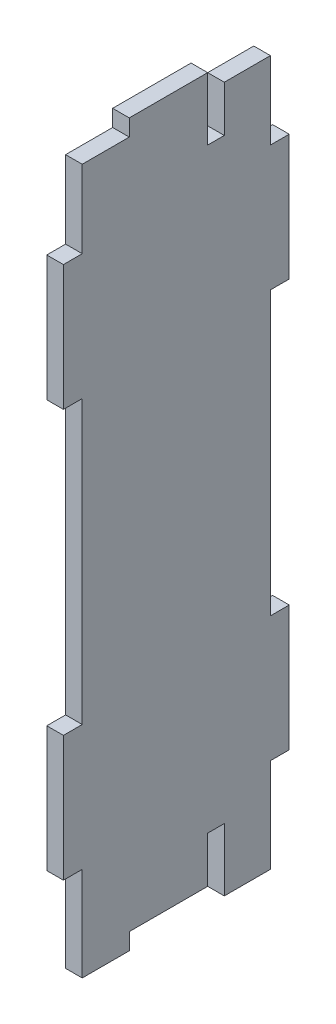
ISO-10303-21;
HEADER;
FILE_DESCRIPTION(('STEP AP214'),'2;1');
FILE_NAME('part.step','',(''),(''),'','','');
FILE_SCHEMA(('AUTOMOTIVE_DESIGN { 1 0 10303 214 1 1 1 1 }'));
ENDSEC;
DATA;
#1=APPLICATION_CONTEXT('core data for automotive mechanical design processes');
#2=APPLICATION_PROTOCOL_DEFINITION('international standard','automotive_design',2000,#1);
#3=PRODUCT_CONTEXT('',#1,'mechanical');
#4=PRODUCT('Part','Part','',(#3));
#5=PRODUCT_RELATED_PRODUCT_CATEGORY('part','',(#4));
#6=PRODUCT_DEFINITION_FORMATION('','',#4);
#7=PRODUCT_DEFINITION_CONTEXT('part definition',#1,'design');
#8=PRODUCT_DEFINITION('design','',#6,#7);
#9=PRODUCT_DEFINITION_SHAPE('','',#8);
#10=(LENGTH_UNIT() NAMED_UNIT(*) SI_UNIT(.MILLI.,.METRE.));
#11=(NAMED_UNIT(*) PLANE_ANGLE_UNIT() SI_UNIT($,.RADIAN.));
#12=(NAMED_UNIT(*) SI_UNIT($,.STERADIAN.) SOLID_ANGLE_UNIT());
#13=UNCERTAINTY_MEASURE_WITH_UNIT(LENGTH_MEASURE(1.E-05),#10,'distance_accuracy_value','');
#14=(GEOMETRIC_REPRESENTATION_CONTEXT(3) GLOBAL_UNCERTAINTY_ASSIGNED_CONTEXT((#13)) GLOBAL_UNIT_ASSIGNED_CONTEXT((#10,
#11,#12)) REPRESENTATION_CONTEXT('',''));
#15=CARTESIAN_POINT('',(0.,0.,0.));
#16=DIRECTION('',(0.,0.,1.));
#17=DIRECTION('',(1.,0.,0.));
#18=AXIS2_PLACEMENT_3D('',#15,#16,#17);
#19=CARTESIAN_POINT('',(0.,0.,30.));
#20=DIRECTION('',(0.,0.,1.));
#21=DIRECTION('',(1.,0.,0.));
#22=AXIS2_PLACEMENT_3D('',#19,#20,#21);
#23=PLANE('',#22);
#24=DIRECTION('',(0.,-1.,0.));
#25=VECTOR('',#24,1.);
#26=CARTESIAN_POINT('',(117.35,5.00000000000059,30.));
#27=LINE('',#26,#25);
#28=CARTESIAN_POINT('',(117.35,85.,30.));
#29=VERTEX_POINT('',#28);
#30=CARTESIAN_POINT('',(117.35,40.,30.));
#31=VERTEX_POINT('',#30);
#32=EDGE_CURVE('E467',#29,#31,#27,.T.);
#33=ORIENTED_EDGE('',*,*,#32,.T.);
#34=DIRECTION('',(-1.,0.,0.));
#35=VECTOR('',#34,1.);
#36=CARTESIAN_POINT('',(117.35,40.,30.));
#37=LINE('',#36,#35);
#38=CARTESIAN_POINT('',(120.,40.,30.));
#39=VERTEX_POINT('',#38);
#40=EDGE_CURVE('E304',#39,#31,#37,.T.);
#41=ORIENTED_EDGE('',*,*,#40,.F.);
#42=DIRECTION('',(0.,1.,0.));
#43=VECTOR('',#42,1.);
#44=CARTESIAN_POINT('',(120.,5.00000000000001,30.));
#45=LINE('',#44,#43);
#46=CARTESIAN_POINT('',(120.,85.,30.));
#47=VERTEX_POINT('',#46);
#48=EDGE_CURVE('E471',#39,#47,#45,.T.);
#49=ORIENTED_EDGE('',*,*,#48,.T.);
#50=DIRECTION('',(1.,0.,0.));
#51=VECTOR('',#50,1.);
#52=CARTESIAN_POINT('',(120.,85.,30.));
#53=LINE('',#52,#51);
#54=EDGE_CURVE('E334',#29,#47,#53,.T.);
#55=ORIENTED_EDGE('',*,*,#54,.F.);
#56=EDGE_LOOP('',(#33,#41,#49,#55));
#57=FACE_BOUND('',#56,.T.);
#58=ADVANCED_FACE('F33',(#57),#23,.T.);
#59=CARTESIAN_POINT('',(120.,5.00000000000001,30.));
#60=VERTEX_POINT('',#59);
#61=CARTESIAN_POINT('',(120.,19.9999999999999,30.));
#62=VERTEX_POINT('',#61);
#63=EDGE_CURVE('E469',#60,#62,#45,.T.);
#64=ORIENTED_EDGE('',*,*,#63,.T.);
#65=DIRECTION('',(1.,0.,0.));
#66=VECTOR('',#65,1.);
#67=CARTESIAN_POINT('',(120.,19.9999999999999,30.));
#68=LINE('',#67,#66);
#69=CARTESIAN_POINT('',(117.35,19.9999999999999,30.));
#70=VERTEX_POINT('',#69);
#71=EDGE_CURVE('E290',#70,#62,#68,.T.);
#72=ORIENTED_EDGE('',*,*,#71,.F.);
#73=CARTESIAN_POINT('',(117.35,5.00000000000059,30.));
#74=VERTEX_POINT('',#73);
#75=EDGE_CURVE('E468',#70,#74,#27,.T.);
#76=ORIENTED_EDGE('',*,*,#75,.T.);
#77=DIRECTION('',(1.,-2.19622538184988E-13,0.));
#78=VECTOR('',#77,1.);
#79=CARTESIAN_POINT('',(120.,5.00000000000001,30.));
#80=LINE('',#79,#78);
#81=EDGE_CURVE('E450',#74,#60,#80,.T.);
#82=ORIENTED_EDGE('',*,*,#81,.T.);
#83=EDGE_LOOP('',(#64,#72,#76,#82));
#84=FACE_BOUND('',#83,.T.);
#85=ADVANCED_FACE('F524',(#84),#23,.T.);
#86=CARTESIAN_POINT('',(0.,0.,0.));
#87=DIRECTION('',(0.,0.,1.));
#88=DIRECTION('',(1.,0.,0.));
#89=AXIS2_PLACEMENT_3D('',#86,#87,#88);
#90=PLANE('',#89);
#91=DIRECTION('',(1.,0.,0.));
#92=VECTOR('',#91,1.);
#93=CARTESIAN_POINT('',(120.,40.,0.));
#94=LINE('',#93,#92);
#95=CARTESIAN_POINT('',(117.35,40.,0.));
#96=VERTEX_POINT('',#95);
#97=CARTESIAN_POINT('',(120.,40.,0.));
#98=VERTEX_POINT('',#97);
#99=EDGE_CURVE('E351',#96,#98,#94,.T.);
#100=ORIENTED_EDGE('',*,*,#99,.F.);
#101=DIRECTION('',(0.,-1.,0.));
#102=VECTOR('',#101,1.);
#103=CARTESIAN_POINT('',(117.35,5.00000000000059,0.));
#104=LINE('',#103,#102);
#105=CARTESIAN_POINT('',(117.35,85.,0.));
#106=VERTEX_POINT('',#105);
#107=EDGE_CURVE('E456',#106,#96,#104,.T.);
#108=ORIENTED_EDGE('',*,*,#107,.F.);
#109=DIRECTION('',(-1.,0.,0.));
#110=VECTOR('',#109,1.);
#111=CARTESIAN_POINT('',(120.,85.,0.));
#112=LINE('',#111,#110);
#113=CARTESIAN_POINT('',(120.,85.,0.));
#114=VERTEX_POINT('',#113);
#115=EDGE_CURVE('E382',#114,#106,#112,.T.);
#116=ORIENTED_EDGE('',*,*,#115,.F.);
#117=DIRECTION('',(0.,1.,0.));
#118=VECTOR('',#117,1.);
#119=CARTESIAN_POINT('',(120.,5.00000000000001,0.));
#120=LINE('',#119,#118);
#121=EDGE_CURVE('E462',#98,#114,#120,.T.);
#122=ORIENTED_EDGE('',*,*,#121,.F.);
#123=EDGE_LOOP('',(#100,#108,#116,#122));
#124=FACE_BOUND('',#123,.T.);
#125=ADVANCED_FACE('F555',(#124),#90,.F.);
#126=DIRECTION('',(-1.,0.,0.));
#127=VECTOR('',#126,1.);
#128=CARTESIAN_POINT('',(120.,19.9999999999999,0.));
#129=LINE('',#128,#127);
#130=CARTESIAN_POINT('',(120.,19.9999999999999,0.));
#131=VERTEX_POINT('',#130);
#132=CARTESIAN_POINT('',(117.35,19.9999999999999,0.));
#133=VERTEX_POINT('',#132);
#134=EDGE_CURVE('E356',#131,#133,#129,.T.);
#135=ORIENTED_EDGE('',*,*,#134,.F.);
#136=CARTESIAN_POINT('',(120.,5.00000000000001,0.));
#137=VERTEX_POINT('',#136);
#138=EDGE_CURVE('E458',#137,#131,#120,.T.);
#139=ORIENTED_EDGE('',*,*,#138,.F.);
#140=DIRECTION('',(1.,-2.19622538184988E-13,0.));
#141=VECTOR('',#140,1.);
#142=CARTESIAN_POINT('',(120.,5.00000000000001,0.));
#143=LINE('',#142,#141);
#144=CARTESIAN_POINT('',(117.35,5.00000000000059,0.));
#145=VERTEX_POINT('',#144);
#146=EDGE_CURVE('E447',#145,#137,#143,.T.);
#147=ORIENTED_EDGE('',*,*,#146,.F.);
#148=EDGE_CURVE('E457',#133,#145,#104,.T.);
#149=ORIENTED_EDGE('',*,*,#148,.F.);
#150=EDGE_LOOP('',(#135,#139,#147,#149));
#151=FACE_BOUND('',#150,.T.);
#152=ADVANCED_FACE('F577',(#151),#90,.F.);
#153=DIRECTION('',(1.,0.,0.));
#154=VECTOR('',#153,1.);
#155=CARTESIAN_POINT('',(120.,105.,0.));
#156=LINE('',#155,#154);
#157=CARTESIAN_POINT('',(117.35,105.,0.));
#158=VERTEX_POINT('',#157);
#159=CARTESIAN_POINT('',(120.,105.,0.));
#160=VERTEX_POINT('',#159);
#161=EDGE_CURVE('E377',#158,#160,#156,.T.);
#162=ORIENTED_EDGE('',*,*,#161,.F.);
#163=CARTESIAN_POINT('',(117.35,117.35,0.));
#164=VERTEX_POINT('',#163);
#165=EDGE_CURVE('E452',#164,#158,#104,.T.);
#166=ORIENTED_EDGE('',*,*,#165,.F.);
#167=DIRECTION('',(1.,0.,0.));
#168=VECTOR('',#167,1.);
#169=CARTESIAN_POINT('',(102.117715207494,117.35,0.));
#170=LINE('',#169,#168);
#171=CARTESIAN_POINT('',(120.,117.35,0.));
#172=VERTEX_POINT('',#171);
#173=EDGE_CURVE('E443',#164,#172,#170,.T.);
#174=ORIENTED_EDGE('',*,*,#173,.T.);
#175=EDGE_CURVE('E463',#160,#172,#120,.T.);
#176=ORIENTED_EDGE('',*,*,#175,.F.);
#177=EDGE_LOOP('',(#162,#166,#174,#176));
#178=FACE_BOUND('',#177,.T.);
#179=ADVANCED_FACE('F572',(#178),#90,.F.);
#180=CARTESIAN_POINT('',(120.,5.00000000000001,145.030528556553));
#181=DIRECTION('',(2.19622538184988E-13,1.,0.));
#182=DIRECTION('',(-1.,2.19622538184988E-13,0.));
#183=AXIS2_PLACEMENT_3D('',#180,#181,#182);
#184=PLANE('',#183);
#185=DIRECTION('',(0.,0.,-1.));
#186=VECTOR('',#185,1.);
#187=CARTESIAN_POINT('',(117.35,5.00000000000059,145.030528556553));
#188=LINE('',#187,#186);
#189=CARTESIAN_POINT('',(117.35,5.00000000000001,22.5000000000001));
#190=VERTEX_POINT('',#189);
#191=EDGE_CURVE('E451',#74,#190,#188,.T.);
#192=ORIENTED_EDGE('',*,*,#191,.T.);
#193=DIRECTION('',(1.,0.,0.));
#194=VECTOR('',#193,1.);
#195=CARTESIAN_POINT('',(102.117715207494,5.00000000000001,22.5000000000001));
#196=LINE('',#195,#194);
#197=CARTESIAN_POINT('',(120.,5.00000000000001,22.5000000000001));
#198=VERTEX_POINT('',#197);
#199=EDGE_CURVE('E419',#190,#198,#196,.T.);
#200=ORIENTED_EDGE('',*,*,#199,.T.);
#201=DIRECTION('',(0.,0.,-1.));
#202=VECTOR('',#201,1.);
#203=CARTESIAN_POINT('',(120.,5.00000000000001,145.030528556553));
#204=LINE('',#203,#202);
#205=EDGE_CURVE('E481',#60,#198,#204,.T.);
#206=ORIENTED_EDGE('',*,*,#205,.F.);
#207=ORIENTED_EDGE('',*,*,#81,.F.);
#208=EDGE_LOOP('',(#192,#200,#206,#207));
#209=FACE_BOUND('',#208,.T.);
#210=ADVANCED_FACE('F530',(#209),#184,.F.);
#211=CARTESIAN_POINT('',(120.,5.00000000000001,145.030528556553));
#212=DIRECTION('',(-1.,0.,0.));
#213=DIRECTION('',(0.,0.,1.));
#214=AXIS2_PLACEMENT_3D('',#211,#212,#213);
#215=PLANE('',#214);
#216=DIRECTION('',(0.,0.,-1.));
#217=VECTOR('',#216,1.);
#218=CARTESIAN_POINT('',(120.,110.,9.99999999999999));
#219=LINE('',#218,#217);
#220=CARTESIAN_POINT('',(120.,110.,9.99999999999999));
#221=VERTEX_POINT('',#220);
#222=CARTESIAN_POINT('',(120.,110.,7.35));
#223=VERTEX_POINT('',#222);
#224=EDGE_CURVE('E247',#221,#223,#219,.T.);
#225=ORIENTED_EDGE('',*,*,#224,.F.);
#226=DIRECTION('',(0.,-1.,0.));
#227=VECTOR('',#226,1.);
#228=CARTESIAN_POINT('',(120.,120.,9.99999999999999));
#229=LINE('',#228,#227);
#230=CARTESIAN_POINT('',(120.,120.,9.99999999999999));
#231=VERTEX_POINT('',#230);
#232=EDGE_CURVE('E253',#231,#221,#229,.T.);
#233=ORIENTED_EDGE('',*,*,#232,.F.);
#234=DIRECTION('',(0.,0.,-1.));
#235=VECTOR('',#234,1.);
#236=CARTESIAN_POINT('',(120.,120.,145.030528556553));
#237=LINE('',#236,#235);
#238=CARTESIAN_POINT('',(120.,120.,22.5000000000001));
#239=VERTEX_POINT('',#238);
#240=EDGE_CURVE('E461',#239,#231,#237,.T.);
#241=ORIENTED_EDGE('',*,*,#240,.F.);
#242=DIRECTION('',(0.,1.,0.));
#243=VECTOR('',#242,1.);
#244=CARTESIAN_POINT('',(120.,117.35,22.5));
#245=LINE('',#244,#243);
#246=CARTESIAN_POINT('',(120.,117.35,22.5));
#247=VERTEX_POINT('',#246);
#248=EDGE_CURVE('E428',#247,#239,#245,.T.);
#249=ORIENTED_EDGE('',*,*,#248,.F.);
#250=DIRECTION('',(0.,0.,-1.));
#251=VECTOR('',#250,1.);
#252=CARTESIAN_POINT('',(120.,117.35,22.5));
#253=LINE('',#252,#251);
#254=CARTESIAN_POINT('',(120.,117.35,30.));
#255=VERTEX_POINT('',#254);
#256=EDGE_CURVE('E430',#255,#247,#253,.T.);
#257=ORIENTED_EDGE('',*,*,#256,.F.);
#258=CARTESIAN_POINT('',(120.,105.,30.));
#259=VERTEX_POINT('',#258);
#260=EDGE_CURVE('E472',#259,#255,#45,.T.);
#261=ORIENTED_EDGE('',*,*,#260,.F.);
#262=DIRECTION('',(0.,0.,-1.));
#263=VECTOR('',#262,1.);
#264=CARTESIAN_POINT('',(120.,105.,53.1747986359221));
#265=LINE('',#264,#263);
#266=CARTESIAN_POINT('',(120.,105.,33.0000000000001));
#267=VERTEX_POINT('',#266);
#268=EDGE_CURVE('E346',#267,#259,#265,.T.);
#269=ORIENTED_EDGE('',*,*,#268,.F.);
#270=DIRECTION('',(0.,-1.,0.));
#271=VECTOR('',#270,1.);
#272=CARTESIAN_POINT('',(120.,105.,33.0000000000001));
#273=LINE('',#272,#271);
#274=CARTESIAN_POINT('',(120.,85.,33.0000000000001));
#275=VERTEX_POINT('',#274);
#276=EDGE_CURVE('E328',#267,#275,#273,.T.);
#277=ORIENTED_EDGE('',*,*,#276,.T.);
#278=DIRECTION('',(0.,0.,-1.));
#279=VECTOR('',#278,1.);
#280=CARTESIAN_POINT('',(120.,85.,53.1747986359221));
#281=LINE('',#280,#279);
#282=EDGE_CURVE('E337',#275,#47,#281,.T.);
#283=ORIENTED_EDGE('',*,*,#282,.T.);
#284=ORIENTED_EDGE('',*,*,#48,.F.);
#285=DIRECTION('',(0.,0.,-1.));
#286=VECTOR('',#285,1.);
#287=CARTESIAN_POINT('',(120.,40.,53.1747986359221));
#288=LINE('',#287,#286);
#289=CARTESIAN_POINT('',(120.,40.,33.0000000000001));
#290=VERTEX_POINT('',#289);
#291=EDGE_CURVE('E313',#290,#39,#288,.T.);
#292=ORIENTED_EDGE('',*,*,#291,.F.);
#293=DIRECTION('',(0.,-1.,0.));
#294=VECTOR('',#293,1.);
#295=CARTESIAN_POINT('',(120.,40.,33.0000000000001));
#296=LINE('',#295,#294);
#297=CARTESIAN_POINT('',(120.,19.9999999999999,33.0000000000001));
#298=VERTEX_POINT('',#297);
#299=EDGE_CURVE('E294',#290,#298,#296,.T.);
#300=ORIENTED_EDGE('',*,*,#299,.T.);
#301=DIRECTION('',(0.,0.,-1.));
#302=VECTOR('',#301,1.);
#303=CARTESIAN_POINT('',(120.,19.9999999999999,53.1747986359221));
#304=LINE('',#303,#302);
#305=EDGE_CURVE('E316',#298,#62,#304,.T.);
#306=ORIENTED_EDGE('',*,*,#305,.T.);
#307=ORIENTED_EDGE('',*,*,#63,.F.);
#308=ORIENTED_EDGE('',*,*,#205,.T.);
#309=DIRECTION('',(0.,-1.,0.));
#310=VECTOR('',#309,1.);
#311=CARTESIAN_POINT('',(120.,5.00000000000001,22.5000000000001));
#312=LINE('',#311,#310);
#313=CARTESIAN_POINT('',(120.,7.65000000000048,22.5000000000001));
#314=VERTEX_POINT('',#313);
#315=EDGE_CURVE('E414',#314,#198,#312,.T.);
#316=ORIENTED_EDGE('',*,*,#315,.F.);
#317=DIRECTION('',(0.,0.,1.));
#318=VECTOR('',#317,1.);
#319=CARTESIAN_POINT('',(120.,7.65000000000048,22.5000000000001));
#320=LINE('',#319,#318);
#321=CARTESIAN_POINT('',(120.,7.65000000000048,9.99999999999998));
#322=VERTEX_POINT('',#321);
#323=EDGE_CURVE('E416',#322,#314,#320,.T.);
#324=ORIENTED_EDGE('',*,*,#323,.F.);
#325=DIRECTION('',(0.,-1.,0.));
#326=VECTOR('',#325,1.);
#327=CARTESIAN_POINT('',(120.,4.99999999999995,9.99999999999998));
#328=LINE('',#327,#326);
#329=CARTESIAN_POINT('',(120.,14.9999999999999,9.99999999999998));
#330=VERTEX_POINT('',#329);
#331=EDGE_CURVE('E56',#330,#322,#328,.T.);
#332=ORIENTED_EDGE('',*,*,#331,.F.);
#333=DIRECTION('',(0.,0.,1.));
#334=VECTOR('',#333,1.);
#335=CARTESIAN_POINT('',(120.,14.9999999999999,9.99999999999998));
#336=LINE('',#335,#334);
#337=CARTESIAN_POINT('',(120.,14.9999999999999,7.34999999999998));
#338=VERTEX_POINT('',#337);
#339=EDGE_CURVE('E273',#338,#330,#336,.T.);
#340=ORIENTED_EDGE('',*,*,#339,.F.);
#341=DIRECTION('',(0.,1.,0.));
#342=VECTOR('',#341,1.);
#343=CARTESIAN_POINT('',(120.,4.99999999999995,7.34999999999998));
#344=LINE('',#343,#342);
#345=CARTESIAN_POINT('',(120.,4.99999999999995,7.34999999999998));
#346=VERTEX_POINT('',#345);
#347=EDGE_CURVE('E270',#346,#338,#344,.T.);
#348=ORIENTED_EDGE('',*,*,#347,.F.);
#349=EDGE_CURVE('E413',#346,#137,#204,.T.);
#350=ORIENTED_EDGE('',*,*,#349,.T.);
#351=ORIENTED_EDGE('',*,*,#138,.T.);
#352=DIRECTION('',(0.,0.,1.));
#353=VECTOR('',#352,1.);
#354=CARTESIAN_POINT('',(120.,19.9999999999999,-23.174798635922));
#355=LINE('',#354,#353);
#356=CARTESIAN_POINT('',(120.,19.9999999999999,-3.));
#357=VERTEX_POINT('',#356);
#358=EDGE_CURVE('E359',#357,#131,#355,.T.);
#359=ORIENTED_EDGE('',*,*,#358,.F.);
#360=DIRECTION('',(0.,1.,0.));
#361=VECTOR('',#360,1.);
#362=CARTESIAN_POINT('',(120.,19.9999999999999,-3.));
#363=LINE('',#362,#361);
#364=CARTESIAN_POINT('',(120.,40.,-3.));
#365=VERTEX_POINT('',#364);
#366=EDGE_CURVE('E331',#357,#365,#363,.T.);
#367=ORIENTED_EDGE('',*,*,#366,.T.);
#368=DIRECTION('',(0.,0.,1.));
#369=VECTOR('',#368,1.);
#370=CARTESIAN_POINT('',(120.,40.,-23.174798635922));
#371=LINE('',#370,#369);
#372=EDGE_CURVE('E362',#365,#98,#371,.T.);
#373=ORIENTED_EDGE('',*,*,#372,.T.);
#374=ORIENTED_EDGE('',*,*,#121,.T.);
#375=DIRECTION('',(0.,0.,1.));
#376=VECTOR('',#375,1.);
#377=CARTESIAN_POINT('',(120.,85.,-23.174798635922));
#378=LINE('',#377,#376);
#379=CARTESIAN_POINT('',(120.,85.,-3.));
#380=VERTEX_POINT('',#379);
#381=EDGE_CURVE('E386',#380,#114,#378,.T.);
#382=ORIENTED_EDGE('',*,*,#381,.F.);
#383=DIRECTION('',(0.,1.,0.));
#384=VECTOR('',#383,1.);
#385=CARTESIAN_POINT('',(120.,105.,-3.));
#386=LINE('',#385,#384);
#387=CARTESIAN_POINT('',(120.,105.,-3.));
#388=VERTEX_POINT('',#387);
#389=EDGE_CURVE('E385',#380,#388,#386,.T.);
#390=ORIENTED_EDGE('',*,*,#389,.T.);
#391=DIRECTION('',(0.,0.,1.));
#392=VECTOR('',#391,1.);
#393=CARTESIAN_POINT('',(120.,105.,-23.174798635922));
#394=LINE('',#393,#392);
#395=EDGE_CURVE('E391',#388,#160,#394,.T.);
#396=ORIENTED_EDGE('',*,*,#395,.T.);
#397=ORIENTED_EDGE('',*,*,#175,.T.);
#398=DIRECTION('',(0.,0.,-1.));
#399=VECTOR('',#398,1.);
#400=CARTESIAN_POINT('',(120.,117.35,0.));
#401=LINE('',#400,#399);
#402=CARTESIAN_POINT('',(120.,117.35,7.35));
#403=VERTEX_POINT('',#402);
#404=EDGE_CURVE('E406',#403,#172,#401,.T.);
#405=ORIENTED_EDGE('',*,*,#404,.F.);
#406=DIRECTION('',(0.,1.,0.));
#407=VECTOR('',#406,1.);
#408=CARTESIAN_POINT('',(120.,120.,7.35));
#409=LINE('',#408,#407);
#410=EDGE_CURVE('E48',#223,#403,#409,.T.);
#411=ORIENTED_EDGE('',*,*,#410,.F.);
#412=EDGE_LOOP('',(#225,#233,#241,#249,#257,#261,#269,#277,#283,#284,#292,#300,#306,#307,#308,
#316,#324,#332,#340,#348,#350,#351,#359,#367,#373,#374,#382,#390,#396,#397,#405,#411));
#413=FACE_BOUND('',#412,.T.);
#414=ADVANCED_FACE('F262',(#413),#215,.F.);
#415=CARTESIAN_POINT('',(120.,120.,145.030528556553));
#416=DIRECTION('',(0.,-1.,0.));
#417=DIRECTION('',(1.,0.,0.));
#418=AXIS2_PLACEMENT_3D('',#415,#416,#417);
#419=PLANE('',#418);
#420=ORIENTED_EDGE('',*,*,#240,.T.);
#421=DIRECTION('',(1.,0.,0.));
#422=VECTOR('',#421,1.);
#423=CARTESIAN_POINT('',(117.,120.,9.99999999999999));
#424=LINE('',#423,#422);
#425=CARTESIAN_POINT('',(117.35,120.,9.99999999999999));
#426=VERTEX_POINT('',#425);
#427=EDGE_CURVE('E256',#426,#231,#424,.T.);
#428=ORIENTED_EDGE('',*,*,#427,.F.);
#429=DIRECTION('',(0.,0.,-1.));
#430=VECTOR('',#429,1.);
#431=CARTESIAN_POINT('',(117.35,120.,145.030528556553));
#432=LINE('',#431,#430);
#433=CARTESIAN_POINT('',(117.35,120.,22.5000000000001));
#434=VERTEX_POINT('',#433);
#435=EDGE_CURVE('E476',#434,#426,#432,.T.);
#436=ORIENTED_EDGE('',*,*,#435,.F.);
#437=DIRECTION('',(1.,0.,0.));
#438=VECTOR('',#437,1.);
#439=CARTESIAN_POINT('',(102.117715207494,120.,22.5000000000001));
#440=LINE('',#439,#438);
#441=EDGE_CURVE('E434',#434,#239,#440,.T.);
#442=ORIENTED_EDGE('',*,*,#441,.T.);
#443=EDGE_LOOP('',(#420,#428,#436,#442));
#444=FACE_BOUND('',#443,.T.);
#445=ADVANCED_FACE('F495',(#444),#419,.F.);
#446=CARTESIAN_POINT('',(117.35,5.00000000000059,145.030528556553));
#447=DIRECTION('',(1.,0.,0.));
#448=DIRECTION('',(0.,0.,-1.));
#449=AXIS2_PLACEMENT_3D('',#446,#447,#448);
#450=PLANE('',#449);
#451=ORIENTED_EDGE('',*,*,#435,.T.);
#452=DIRECTION('',(0.,-1.,0.));
#453=VECTOR('',#452,1.);
#454=CARTESIAN_POINT('',(117.35,5.00000000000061,9.99999999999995));
#455=LINE('',#454,#453);
#456=CARTESIAN_POINT('',(117.35,110.,9.99999999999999));
#457=VERTEX_POINT('',#456);
#458=EDGE_CURVE('E11',#426,#457,#455,.T.);
#459=ORIENTED_EDGE('',*,*,#458,.T.);
#460=DIRECTION('',(0.,0.,-1.));
#461=VECTOR('',#460,1.);
#462=CARTESIAN_POINT('',(117.35,110.,145.030528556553));
#463=LINE('',#462,#461);
#464=CARTESIAN_POINT('',(117.35,110.,7.35));
#465=VERTEX_POINT('',#464);
#466=EDGE_CURVE('E41',#457,#465,#463,.T.);
#467=ORIENTED_EDGE('',*,*,#466,.T.);
#468=DIRECTION('',(0.,1.,0.));
#469=VECTOR('',#468,1.);
#470=CARTESIAN_POINT('',(117.35,5.0000000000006,7.35));
#471=LINE('',#470,#469);
#472=CARTESIAN_POINT('',(117.35,117.35,7.35));
#473=VERTEX_POINT('',#472);
#474=EDGE_CURVE('E284',#465,#473,#471,.T.);
#475=ORIENTED_EDGE('',*,*,#474,.T.);
#476=DIRECTION('',(0.,0.,1.));
#477=VECTOR('',#476,1.);
#478=CARTESIAN_POINT('',(117.35,117.35,0.));
#479=LINE('',#478,#477);
#480=EDGE_CURVE('E431',#164,#473,#479,.T.);
#481=ORIENTED_EDGE('',*,*,#480,.F.);
#482=ORIENTED_EDGE('',*,*,#165,.T.);
#483=DIRECTION('',(0.,0.,1.));
#484=VECTOR('',#483,1.);
#485=CARTESIAN_POINT('',(117.35,105.,-23.174798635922));
#486=LINE('',#485,#484);
#487=CARTESIAN_POINT('',(117.35,105.,-3.));
#488=VERTEX_POINT('',#487);
#489=EDGE_CURVE('E381',#488,#158,#486,.T.);
#490=ORIENTED_EDGE('',*,*,#489,.F.);
#491=DIRECTION('',(0.,-1.,0.));
#492=VECTOR('',#491,1.);
#493=CARTESIAN_POINT('',(117.35,105.,-3.));
#494=LINE('',#493,#492);
#495=CARTESIAN_POINT('',(117.35,85.,-3.));
#496=VERTEX_POINT('',#495);
#497=EDGE_CURVE('E380',#488,#496,#494,.T.);
#498=ORIENTED_EDGE('',*,*,#497,.T.);
#499=DIRECTION('',(0.,0.,1.));
#500=VECTOR('',#499,1.);
#501=CARTESIAN_POINT('',(117.35,85.,-23.174798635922));
#502=LINE('',#501,#500);
#503=EDGE_CURVE('E395',#496,#106,#502,.T.);
#504=ORIENTED_EDGE('',*,*,#503,.T.);
#505=ORIENTED_EDGE('',*,*,#107,.T.);
#506=DIRECTION('',(0.,0.,1.));
#507=VECTOR('',#506,1.);
#508=CARTESIAN_POINT('',(117.35,40.,-23.174798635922));
#509=LINE('',#508,#507);
#510=CARTESIAN_POINT('',(117.35,40.,-3.));
#511=VERTEX_POINT('',#510);
#512=EDGE_CURVE('E355',#511,#96,#509,.T.);
#513=ORIENTED_EDGE('',*,*,#512,.F.);
#514=DIRECTION('',(0.,-1.,0.));
#515=VECTOR('',#514,1.);
#516=CARTESIAN_POINT('',(117.35,19.9999999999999,-3.));
#517=LINE('',#516,#515);
#518=CARTESIAN_POINT('',(117.35,19.9999999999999,-3.));
#519=VERTEX_POINT('',#518);
#520=EDGE_CURVE('E354',#511,#519,#517,.T.);
#521=ORIENTED_EDGE('',*,*,#520,.T.);
#522=DIRECTION('',(0.,0.,1.));
#523=VECTOR('',#522,1.);
#524=CARTESIAN_POINT('',(117.35,19.9999999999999,-23.174798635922));
#525=LINE('',#524,#523);
#526=EDGE_CURVE('E366',#519,#133,#525,.T.);
#527=ORIENTED_EDGE('',*,*,#526,.T.);
#528=ORIENTED_EDGE('',*,*,#148,.T.);
#529=CARTESIAN_POINT('',(117.35,4.99999999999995,7.34999999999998));
#530=VERTEX_POINT('',#529);
#531=EDGE_CURVE('E455',#530,#145,#188,.T.);
#532=ORIENTED_EDGE('',*,*,#531,.F.);
#533=DIRECTION('',(0.,1.,0.));
#534=VECTOR('',#533,1.);
#535=CARTESIAN_POINT('',(117.35,5.00000000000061,7.35));
#536=LINE('',#535,#534);
#537=CARTESIAN_POINT('',(117.35,14.9999999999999,7.34999999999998));
#538=VERTEX_POINT('',#537);
#539=EDGE_CURVE('E287',#530,#538,#536,.T.);
#540=ORIENTED_EDGE('',*,*,#539,.T.);
#541=DIRECTION('',(0.,0.,1.));
#542=VECTOR('',#541,1.);
#543=CARTESIAN_POINT('',(117.35,14.9999999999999,145.030528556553));
#544=LINE('',#543,#542);
#545=CARTESIAN_POINT('',(117.35,14.9999999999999,9.99999999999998));
#546=VERTEX_POINT('',#545);
#547=EDGE_CURVE('E487',#538,#546,#544,.T.);
#548=ORIENTED_EDGE('',*,*,#547,.T.);
#549=DIRECTION('',(0.,-1.,0.));
#550=VECTOR('',#549,1.);
#551=CARTESIAN_POINT('',(117.35,5.00000000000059,9.99999999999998));
#552=LINE('',#551,#550);
#553=CARTESIAN_POINT('',(117.35,7.65000000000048,9.99999999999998));
#554=VERTEX_POINT('',#553);
#555=EDGE_CURVE('E268',#546,#554,#552,.T.);
#556=ORIENTED_EDGE('',*,*,#555,.T.);
#557=DIRECTION('',(0.,0.,-1.));
#558=VECTOR('',#557,1.);
#559=CARTESIAN_POINT('',(117.35,7.65000000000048,22.5000000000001));
#560=LINE('',#559,#558);
#561=CARTESIAN_POINT('',(117.35,7.65000000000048,22.5000000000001));
#562=VERTEX_POINT('',#561);
#563=EDGE_CURVE('E407',#562,#554,#560,.T.);
#564=ORIENTED_EDGE('',*,*,#563,.F.);
#565=DIRECTION('',(0.,1.,0.));
#566=VECTOR('',#565,1.);
#567=CARTESIAN_POINT('',(117.35,5.00000000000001,22.5000000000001));
#568=LINE('',#567,#566);
#569=EDGE_CURVE('E410',#190,#562,#568,.T.);
#570=ORIENTED_EDGE('',*,*,#569,.F.);
#571=ORIENTED_EDGE('',*,*,#191,.F.);
#572=ORIENTED_EDGE('',*,*,#75,.F.);
#573=DIRECTION('',(0.,0.,-1.));
#574=VECTOR('',#573,1.);
#575=CARTESIAN_POINT('',(117.35,19.9999999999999,53.1747986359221));
#576=LINE('',#575,#574);
#577=CARTESIAN_POINT('',(117.35,19.9999999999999,33.0000000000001));
#578=VERTEX_POINT('',#577);
#579=EDGE_CURVE('E307',#578,#70,#576,.T.);
#580=ORIENTED_EDGE('',*,*,#579,.F.);
#581=DIRECTION('',(0.,1.,0.));
#582=VECTOR('',#581,1.);
#583=CARTESIAN_POINT('',(117.35,19.9999999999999,33.0000000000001));
#584=LINE('',#583,#582);
#585=CARTESIAN_POINT('',(117.35,40.,33.0000000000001));
#586=VERTEX_POINT('',#585);
#587=EDGE_CURVE('E295',#578,#586,#584,.T.);
#588=ORIENTED_EDGE('',*,*,#587,.T.);
#589=DIRECTION('',(0.,0.,-1.));
#590=VECTOR('',#589,1.);
#591=CARTESIAN_POINT('',(117.35,40.,53.1747986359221));
#592=LINE('',#591,#590);
#593=EDGE_CURVE('E310',#586,#31,#592,.T.);
#594=ORIENTED_EDGE('',*,*,#593,.T.);
#595=ORIENTED_EDGE('',*,*,#32,.F.);
#596=DIRECTION('',(0.,0.,-1.));
#597=VECTOR('',#596,1.);
#598=CARTESIAN_POINT('',(117.35,85.,53.1747986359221));
#599=LINE('',#598,#597);
#600=CARTESIAN_POINT('',(117.35,85.,33.0000000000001));
#601=VERTEX_POINT('',#600);
#602=EDGE_CURVE('E340',#601,#29,#599,.T.);
#603=ORIENTED_EDGE('',*,*,#602,.F.);
#604=DIRECTION('',(0.,1.,0.));
#605=VECTOR('',#604,1.);
#606=CARTESIAN_POINT('',(117.35,85.,33.0000000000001));
#607=LINE('',#606,#605);
#608=CARTESIAN_POINT('',(117.35,105.,33.0000000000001));
#609=VERTEX_POINT('',#608);
#610=EDGE_CURVE('E321',#601,#609,#607,.T.);
#611=ORIENTED_EDGE('',*,*,#610,.T.);
#612=DIRECTION('',(0.,0.,-1.));
#613=VECTOR('',#612,1.);
#614=CARTESIAN_POINT('',(117.35,105.,53.1747986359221));
#615=LINE('',#614,#613);
#616=CARTESIAN_POINT('',(117.35,105.,30.));
#617=VERTEX_POINT('',#616);
#618=EDGE_CURVE('E343',#609,#617,#615,.T.);
#619=ORIENTED_EDGE('',*,*,#618,.T.);
#620=CARTESIAN_POINT('',(117.35,117.35,30.));
#621=VERTEX_POINT('',#620);
#622=EDGE_CURVE('E464',#621,#617,#27,.T.);
#623=ORIENTED_EDGE('',*,*,#622,.F.);
#624=DIRECTION('',(0.,0.,1.));
#625=VECTOR('',#624,1.);
#626=CARTESIAN_POINT('',(117.35,117.35,22.5));
#627=LINE('',#626,#625);
#628=CARTESIAN_POINT('',(117.35,117.35,22.5));
#629=VERTEX_POINT('',#628);
#630=EDGE_CURVE('E424',#629,#621,#627,.T.);
#631=ORIENTED_EDGE('',*,*,#630,.F.);
#632=DIRECTION('',(0.,-1.,0.));
#633=VECTOR('',#632,1.);
#634=CARTESIAN_POINT('',(117.35,117.35,22.5));
#635=LINE('',#634,#633);
#636=EDGE_CURVE('E417',#434,#629,#635,.T.);
#637=ORIENTED_EDGE('',*,*,#636,.F.);
#638=EDGE_LOOP('',(#451,#459,#467,#475,#481,#482,#490,#498,#504,#505,#513,#521,#527,#528,#532,
#540,#548,#556,#564,#570,#571,#572,#580,#588,#594,#595,#603,#611,#619,#623,#631,#637));
#639=FACE_BOUND('',#638,.T.);
#640=ADVANCED_FACE('F490',(#639),#450,.F.);
#641=ORIENTED_EDGE('',*,*,#349,.F.);
#642=DIRECTION('',(1.,0.,0.));
#643=VECTOR('',#642,1.);
#644=CARTESIAN_POINT('',(117.,4.99999999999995,7.34999999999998));
#645=LINE('',#644,#643);
#646=EDGE_CURVE('E277',#530,#346,#645,.T.);
#647=ORIENTED_EDGE('',*,*,#646,.F.);
#648=ORIENTED_EDGE('',*,*,#531,.T.);
#649=ORIENTED_EDGE('',*,*,#146,.T.);
#650=EDGE_LOOP('',(#641,#647,#648,#649));
#651=FACE_BOUND('',#650,.T.);
#652=ADVANCED_FACE('F557',(#651),#184,.F.);
#653=DIRECTION('',(-1.,0.,0.));
#654=VECTOR('',#653,1.);
#655=CARTESIAN_POINT('',(117.35,105.,30.));
#656=LINE('',#655,#654);
#657=EDGE_CURVE('E301',#259,#617,#656,.T.);
#658=ORIENTED_EDGE('',*,*,#657,.F.);
#659=ORIENTED_EDGE('',*,*,#260,.T.);
#660=DIRECTION('',(1.,0.,0.));
#661=VECTOR('',#660,1.);
#662=CARTESIAN_POINT('',(102.117715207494,117.35,30.));
#663=LINE('',#662,#661);
#664=EDGE_CURVE('E436',#621,#255,#663,.T.);
#665=ORIENTED_EDGE('',*,*,#664,.F.);
#666=ORIENTED_EDGE('',*,*,#622,.T.);
#667=EDGE_LOOP('',(#658,#659,#665,#666));
#668=FACE_BOUND('',#667,.T.);
#669=ADVANCED_FACE('F35',(#668),#23,.T.);
#670=CARTESIAN_POINT('',(102.117715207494,117.35,22.5));
#671=DIRECTION('',(0.,0.,-1.));
#672=DIRECTION('',(0.,1.,0.));
#673=AXIS2_PLACEMENT_3D('',#670,#671,#672);
#674=PLANE('',#673);
#675=ORIENTED_EDGE('',*,*,#636,.T.);
#676=DIRECTION('',(1.,0.,0.));
#677=VECTOR('',#676,1.);
#678=CARTESIAN_POINT('',(102.117715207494,117.35,22.5));
#679=LINE('',#678,#677);
#680=EDGE_CURVE('E426',#629,#247,#679,.T.);
#681=ORIENTED_EDGE('',*,*,#680,.T.);
#682=ORIENTED_EDGE('',*,*,#248,.T.);
#683=ORIENTED_EDGE('',*,*,#441,.F.);
#684=EDGE_LOOP('',(#675,#681,#682,#683));
#685=FACE_BOUND('',#684,.T.);
#686=ADVANCED_FACE('F500',(#685),#674,.F.);
#687=CARTESIAN_POINT('',(102.117715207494,117.35,22.5));
#688=DIRECTION('',(0.,-1.,0.));
#689=DIRECTION('',(0.,0.,-1.));
#690=AXIS2_PLACEMENT_3D('',#687,#688,#689);
#691=PLANE('',#690);
#692=ORIENTED_EDGE('',*,*,#630,.T.);
#693=ORIENTED_EDGE('',*,*,#664,.T.);
#694=ORIENTED_EDGE('',*,*,#256,.T.);
#695=ORIENTED_EDGE('',*,*,#680,.F.);
#696=EDGE_LOOP('',(#692,#693,#694,#695));
#697=FACE_BOUND('',#696,.T.);
#698=ADVANCED_FACE('F504',(#697),#691,.F.);
#699=CARTESIAN_POINT('',(102.117715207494,117.35,0.));
#700=DIRECTION('',(0.,-1.,0.));
#701=DIRECTION('',(0.,0.,-1.));
#702=AXIS2_PLACEMENT_3D('',#699,#700,#701);
#703=PLANE('',#702);
#704=ORIENTED_EDGE('',*,*,#480,.T.);
#705=DIRECTION('',(1.,0.,0.));
#706=VECTOR('',#705,1.);
#707=CARTESIAN_POINT('',(102.117715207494,117.35,7.35));
#708=LINE('',#707,#706);
#709=EDGE_CURVE('E485',#473,#403,#708,.T.);
#710=ORIENTED_EDGE('',*,*,#709,.T.);
#711=ORIENTED_EDGE('',*,*,#404,.T.);
#712=ORIENTED_EDGE('',*,*,#173,.F.);
#713=EDGE_LOOP('',(#704,#710,#711,#712));
#714=FACE_BOUND('',#713,.T.);
#715=ADVANCED_FACE('F619',(#714),#703,.F.);
#716=CARTESIAN_POINT('',(102.117715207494,5.00000000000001,22.5000000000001));
#717=DIRECTION('',(0.,0.,1.));
#718=DIRECTION('',(1.,0.,0.));
#719=AXIS2_PLACEMENT_3D('',#716,#717,#718);
#720=PLANE('',#719);
#721=ORIENTED_EDGE('',*,*,#569,.T.);
#722=DIRECTION('',(1.,0.,0.));
#723=VECTOR('',#722,1.);
#724=CARTESIAN_POINT('',(102.117715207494,7.65000000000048,22.5000000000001));
#725=LINE('',#724,#723);
#726=EDGE_CURVE('E411',#562,#314,#725,.T.);
#727=ORIENTED_EDGE('',*,*,#726,.T.);
#728=ORIENTED_EDGE('',*,*,#315,.T.);
#729=ORIENTED_EDGE('',*,*,#199,.F.);
#730=EDGE_LOOP('',(#721,#727,#728,#729));
#731=FACE_BOUND('',#730,.T.);
#732=ADVANCED_FACE('F617',(#731),#720,.F.);
#733=CARTESIAN_POINT('',(102.117715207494,7.65000000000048,22.5000000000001));
#734=DIRECTION('',(0.,1.,0.));
#735=DIRECTION('',(0.,0.,1.));
#736=AXIS2_PLACEMENT_3D('',#733,#734,#735);
#737=PLANE('',#736);
#738=ORIENTED_EDGE('',*,*,#563,.T.);
#739=DIRECTION('',(1.,0.,0.));
#740=VECTOR('',#739,1.);
#741=CARTESIAN_POINT('',(102.117715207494,7.65000000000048,9.99999999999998));
#742=LINE('',#741,#740);
#743=EDGE_CURVE('E466',#554,#322,#742,.T.);
#744=ORIENTED_EDGE('',*,*,#743,.T.);
#745=ORIENTED_EDGE('',*,*,#323,.T.);
#746=ORIENTED_EDGE('',*,*,#726,.F.);
#747=EDGE_LOOP('',(#738,#744,#745,#746));
#748=FACE_BOUND('',#747,.T.);
#749=ADVANCED_FACE('F615',(#748),#737,.F.);
#750=CARTESIAN_POINT('',(0.,0.,-3.));
#751=DIRECTION('',(0.,0.,1.));
#752=DIRECTION('',(1.,0.,0.));
#753=AXIS2_PLACEMENT_3D('',#750,#751,#752);
#754=PLANE('',#753);
#755=ORIENTED_EDGE('',*,*,#389,.F.);
#756=DIRECTION('',(1.,0.,0.));
#757=VECTOR('',#756,1.);
#758=CARTESIAN_POINT('',(120.,85.,-3.));
#759=LINE('',#758,#757);
#760=EDGE_CURVE('E392',#496,#380,#759,.T.);
#761=ORIENTED_EDGE('',*,*,#760,.F.);
#762=ORIENTED_EDGE('',*,*,#497,.F.);
#763=DIRECTION('',(-1.,0.,0.));
#764=VECTOR('',#763,1.);
#765=CARTESIAN_POINT('',(120.,105.,-3.));
#766=LINE('',#765,#764);
#767=EDGE_CURVE('E358',#388,#488,#766,.T.);
#768=ORIENTED_EDGE('',*,*,#767,.F.);
#769=EDGE_LOOP('',(#755,#761,#762,#768));
#770=FACE_BOUND('',#769,.T.);
#771=ADVANCED_FACE('F625',(#770),#754,.F.);
#772=CARTESIAN_POINT('',(120.,105.,-23.174798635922));
#773=DIRECTION('',(0.,-1.,0.));
#774=DIRECTION('',(0.,0.,-1.));
#775=AXIS2_PLACEMENT_3D('',#772,#773,#774);
#776=PLANE('',#775);
#777=ORIENTED_EDGE('',*,*,#395,.F.);
#778=ORIENTED_EDGE('',*,*,#767,.T.);
#779=ORIENTED_EDGE('',*,*,#489,.T.);
#780=ORIENTED_EDGE('',*,*,#161,.T.);
#781=EDGE_LOOP('',(#777,#778,#779,#780));
#782=FACE_BOUND('',#781,.T.);
#783=ADVANCED_FACE('F795',(#782),#776,.F.);
#784=CARTESIAN_POINT('',(120.,85.,-23.174798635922));
#785=DIRECTION('',(0.,1.,0.));
#786=DIRECTION('',(0.,0.,1.));
#787=AXIS2_PLACEMENT_3D('',#784,#785,#786);
#788=PLANE('',#787);
#789=ORIENTED_EDGE('',*,*,#503,.F.);
#790=ORIENTED_EDGE('',*,*,#760,.T.);
#791=ORIENTED_EDGE('',*,*,#381,.T.);
#792=ORIENTED_EDGE('',*,*,#115,.T.);
#793=EDGE_LOOP('',(#789,#790,#791,#792));
#794=FACE_BOUND('',#793,.T.);
#795=ADVANCED_FACE('F785',(#794),#788,.F.);
#796=CARTESIAN_POINT('',(0.,0.,-3.));
#797=DIRECTION('',(0.,0.,1.));
#798=DIRECTION('',(1.,0.,0.));
#799=AXIS2_PLACEMENT_3D('',#796,#797,#798);
#800=PLANE('',#799);
#801=DIRECTION('',(1.,0.,0.));
#802=VECTOR('',#801,1.);
#803=CARTESIAN_POINT('',(120.,19.9999999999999,-3.));
#804=LINE('',#803,#802);
#805=EDGE_CURVE('E363',#519,#357,#804,.T.);
#806=ORIENTED_EDGE('',*,*,#805,.F.);
#807=ORIENTED_EDGE('',*,*,#520,.F.);
#808=DIRECTION('',(-1.,0.,0.));
#809=VECTOR('',#808,1.);
#810=CARTESIAN_POINT('',(120.,40.,-3.));
#811=LINE('',#810,#809);
#812=EDGE_CURVE('E369',#365,#511,#811,.T.);
#813=ORIENTED_EDGE('',*,*,#812,.F.);
#814=ORIENTED_EDGE('',*,*,#366,.F.);
#815=EDGE_LOOP('',(#806,#807,#813,#814));
#816=FACE_BOUND('',#815,.T.);
#817=ADVANCED_FACE('F776',(#816),#800,.F.);
#818=CARTESIAN_POINT('',(120.,40.,-23.174798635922));
#819=DIRECTION('',(0.,-1.,0.));
#820=DIRECTION('',(0.,0.,-1.));
#821=AXIS2_PLACEMENT_3D('',#818,#819,#820);
#822=PLANE('',#821);
#823=ORIENTED_EDGE('',*,*,#372,.F.);
#824=ORIENTED_EDGE('',*,*,#812,.T.);
#825=ORIENTED_EDGE('',*,*,#512,.T.);
#826=ORIENTED_EDGE('',*,*,#99,.T.);
#827=EDGE_LOOP('',(#823,#824,#825,#826));
#828=FACE_BOUND('',#827,.T.);
#829=ADVANCED_FACE('F766',(#828),#822,.F.);
#830=CARTESIAN_POINT('',(120.,19.9999999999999,-23.174798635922));
#831=DIRECTION('',(0.,1.,0.));
#832=DIRECTION('',(0.,0.,1.));
#833=AXIS2_PLACEMENT_3D('',#830,#831,#832);
#834=PLANE('',#833);
#835=ORIENTED_EDGE('',*,*,#526,.F.);
#836=ORIENTED_EDGE('',*,*,#805,.T.);
#837=ORIENTED_EDGE('',*,*,#358,.T.);
#838=ORIENTED_EDGE('',*,*,#134,.T.);
#839=EDGE_LOOP('',(#835,#836,#837,#838));
#840=FACE_BOUND('',#839,.T.);
#841=ADVANCED_FACE('F739',(#840),#834,.F.);
#842=CARTESIAN_POINT('',(120.,85.,53.1747986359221));
#843=DIRECTION('',(0.,1.,0.));
#844=DIRECTION('',(0.,0.,1.));
#845=AXIS2_PLACEMENT_3D('',#842,#843,#844);
#846=PLANE('',#845);
#847=ORIENTED_EDGE('',*,*,#282,.F.);
#848=DIRECTION('',(-1.,0.,0.));
#849=VECTOR('',#848,1.);
#850=CARTESIAN_POINT('',(120.,85.,33.0000000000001));
#851=LINE('',#850,#849);
#852=EDGE_CURVE('E325',#275,#601,#851,.T.);
#853=ORIENTED_EDGE('',*,*,#852,.T.);
#854=ORIENTED_EDGE('',*,*,#602,.T.);
#855=ORIENTED_EDGE('',*,*,#54,.T.);
#856=EDGE_LOOP('',(#847,#853,#854,#855));
#857=FACE_BOUND('',#856,.T.);
#858=ADVANCED_FACE('F519',(#857),#846,.F.);
#859=CARTESIAN_POINT('',(117.35,105.,53.1747986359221));
#860=DIRECTION('',(0.,-1.,0.));
#861=DIRECTION('',(0.,0.,-1.));
#862=AXIS2_PLACEMENT_3D('',#859,#860,#861);
#863=PLANE('',#862);
#864=ORIENTED_EDGE('',*,*,#618,.F.);
#865=DIRECTION('',(1.,0.,0.));
#866=VECTOR('',#865,1.);
#867=CARTESIAN_POINT('',(117.35,105.,33.0000000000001));
#868=LINE('',#867,#866);
#869=EDGE_CURVE('E324',#609,#267,#868,.T.);
#870=ORIENTED_EDGE('',*,*,#869,.T.);
#871=ORIENTED_EDGE('',*,*,#268,.T.);
#872=ORIENTED_EDGE('',*,*,#657,.T.);
#873=EDGE_LOOP('',(#864,#870,#871,#872));
#874=FACE_BOUND('',#873,.T.);
#875=ADVANCED_FACE('F511',(#874),#863,.F.);
#876=CARTESIAN_POINT('',(124.999999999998,125.,33.0000000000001));
#877=DIRECTION('',(0.,0.,-1.));
#878=DIRECTION('',(-1.,0.,0.));
#879=AXIS2_PLACEMENT_3D('',#876,#877,#878);
#880=PLANE('',#879);
#881=ORIENTED_EDGE('',*,*,#869,.F.);
#882=ORIENTED_EDGE('',*,*,#610,.F.);
#883=ORIENTED_EDGE('',*,*,#852,.F.);
#884=ORIENTED_EDGE('',*,*,#276,.F.);
#885=EDGE_LOOP('',(#881,#882,#883,#884));
#886=FACE_BOUND('',#885,.T.);
#887=ADVANCED_FACE('F541',(#886),#880,.F.);
#888=CARTESIAN_POINT('',(117.35,40.,53.1747986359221));
#889=DIRECTION('',(0.,-1.,0.));
#890=DIRECTION('',(0.,0.,-1.));
#891=AXIS2_PLACEMENT_3D('',#888,#889,#890);
#892=PLANE('',#891);
#893=ORIENTED_EDGE('',*,*,#593,.F.);
#894=DIRECTION('',(1.,0.,0.));
#895=VECTOR('',#894,1.);
#896=CARTESIAN_POINT('',(117.35,40.,33.0000000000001));
#897=LINE('',#896,#895);
#898=EDGE_CURVE('E291',#586,#290,#897,.T.);
#899=ORIENTED_EDGE('',*,*,#898,.T.);
#900=ORIENTED_EDGE('',*,*,#291,.T.);
#901=ORIENTED_EDGE('',*,*,#40,.T.);
#902=EDGE_LOOP('',(#893,#899,#900,#901));
#903=FACE_BOUND('',#902,.T.);
#904=ADVANCED_FACE('F539',(#903),#892,.F.);
#905=CARTESIAN_POINT('',(120.,19.9999999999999,53.1747986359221));
#906=DIRECTION('',(0.,1.,0.));
#907=DIRECTION('',(0.,0.,1.));
#908=AXIS2_PLACEMENT_3D('',#905,#906,#907);
#909=PLANE('',#908);
#910=ORIENTED_EDGE('',*,*,#305,.F.);
#911=DIRECTION('',(-1.,0.,0.));
#912=VECTOR('',#911,1.);
#913=CARTESIAN_POINT('',(120.,19.9999999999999,33.0000000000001));
#914=LINE('',#913,#912);
#915=EDGE_CURVE('E298',#298,#578,#914,.T.);
#916=ORIENTED_EDGE('',*,*,#915,.T.);
#917=ORIENTED_EDGE('',*,*,#579,.T.);
#918=ORIENTED_EDGE('',*,*,#71,.T.);
#919=EDGE_LOOP('',(#910,#916,#917,#918));
#920=FACE_BOUND('',#919,.T.);
#921=ADVANCED_FACE('F535',(#920),#909,.F.);
#922=CARTESIAN_POINT('',(124.999999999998,125.,33.0000000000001));
#923=DIRECTION('',(0.,0.,-1.));
#924=DIRECTION('',(-1.,0.,0.));
#925=AXIS2_PLACEMENT_3D('',#922,#923,#924);
#926=PLANE('',#925);
#927=ORIENTED_EDGE('',*,*,#299,.F.);
#928=ORIENTED_EDGE('',*,*,#898,.F.);
#929=ORIENTED_EDGE('',*,*,#587,.F.);
#930=ORIENTED_EDGE('',*,*,#915,.F.);
#931=EDGE_LOOP('',(#927,#928,#929,#930));
#932=FACE_BOUND('',#931,.T.);
#933=ADVANCED_FACE('F537',(#932),#926,.F.);
#934=CARTESIAN_POINT('',(117.,14.9999999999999,9.99999999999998));
#935=DIRECTION('',(0.,1.,0.));
#936=DIRECTION('',(0.,0.,1.));
#937=AXIS2_PLACEMENT_3D('',#934,#935,#936);
#938=PLANE('',#937);
#939=DIRECTION('',(1.,0.,0.));
#940=VECTOR('',#939,1.);
#941=CARTESIAN_POINT('',(117.,14.9999999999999,7.34999999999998));
#942=LINE('',#941,#940);
#943=EDGE_CURVE('E279',#538,#338,#942,.T.);
#944=ORIENTED_EDGE('',*,*,#943,.T.);
#945=ORIENTED_EDGE('',*,*,#339,.T.);
#946=DIRECTION('',(1.,0.,0.));
#947=VECTOR('',#946,1.);
#948=CARTESIAN_POINT('',(117.,14.9999999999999,9.99999999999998));
#949=LINE('',#948,#947);
#950=EDGE_CURVE('E260',#546,#330,#949,.T.);
#951=ORIENTED_EDGE('',*,*,#950,.F.);
#952=ORIENTED_EDGE('',*,*,#547,.F.);
#953=EDGE_LOOP('',(#944,#945,#951,#952));
#954=FACE_BOUND('',#953,.T.);
#955=ADVANCED_FACE('F612',(#954),#938,.F.);
#956=CARTESIAN_POINT('',(117.,4.99999999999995,7.34999999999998));
#957=DIRECTION('',(0.,0.,-1.));
#958=DIRECTION('',(0.,1.,0.));
#959=AXIS2_PLACEMENT_3D('',#956,#957,#958);
#960=PLANE('',#959);
#961=ORIENTED_EDGE('',*,*,#646,.T.);
#962=ORIENTED_EDGE('',*,*,#347,.T.);
#963=ORIENTED_EDGE('',*,*,#943,.F.);
#964=ORIENTED_EDGE('',*,*,#539,.F.);
#965=EDGE_LOOP('',(#961,#962,#963,#964));
#966=FACE_BOUND('',#965,.T.);
#967=ADVANCED_FACE('F606',(#966),#960,.F.);
#968=CARTESIAN_POINT('',(117.,4.99999999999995,9.99999999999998));
#969=DIRECTION('',(0.,0.,1.));
#970=DIRECTION('',(1.,0.,0.));
#971=AXIS2_PLACEMENT_3D('',#968,#969,#970);
#972=PLANE('',#971);
#973=ORIENTED_EDGE('',*,*,#950,.T.);
#974=ORIENTED_EDGE('',*,*,#331,.T.);
#975=ORIENTED_EDGE('',*,*,#743,.F.);
#976=ORIENTED_EDGE('',*,*,#555,.F.);
#977=EDGE_LOOP('',(#973,#974,#975,#976));
#978=FACE_BOUND('',#977,.T.);
#979=ADVANCED_FACE('F670',(#978),#972,.F.);
#980=CARTESIAN_POINT('',(117.,120.,9.99999999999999));
#981=DIRECTION('',(0.,0.,1.));
#982=DIRECTION('',(0.,-1.,0.));
#983=AXIS2_PLACEMENT_3D('',#980,#981,#982);
#984=PLANE('',#983);
#985=ORIENTED_EDGE('',*,*,#427,.T.);
#986=ORIENTED_EDGE('',*,*,#232,.T.);
#987=DIRECTION('',(1.,0.,0.));
#988=VECTOR('',#987,1.);
#989=CARTESIAN_POINT('',(117.,110.,9.99999999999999));
#990=LINE('',#989,#988);
#991=EDGE_CURVE('E242',#457,#221,#990,.T.);
#992=ORIENTED_EDGE('',*,*,#991,.F.);
#993=ORIENTED_EDGE('',*,*,#458,.F.);
#994=EDGE_LOOP('',(#985,#986,#992,#993));
#995=FACE_BOUND('',#994,.T.);
#996=ADVANCED_FACE('F254',(#995),#984,.F.);
#997=CARTESIAN_POINT('',(117.,110.,9.99999999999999));
#998=DIRECTION('',(0.,-1.,0.));
#999=DIRECTION('',(0.,0.,-1.));
#1000=AXIS2_PLACEMENT_3D('',#997,#998,#999);
#1001=PLANE('',#1000);
#1002=ORIENTED_EDGE('',*,*,#991,.T.);
#1003=ORIENTED_EDGE('',*,*,#224,.T.);
#1004=DIRECTION('',(1.,0.,0.));
#1005=VECTOR('',#1004,1.);
#1006=CARTESIAN_POINT('',(117.,110.,7.35));
#1007=LINE('',#1006,#1005);
#1008=EDGE_CURVE('E250',#465,#223,#1007,.T.);
#1009=ORIENTED_EDGE('',*,*,#1008,.F.);
#1010=ORIENTED_EDGE('',*,*,#466,.F.);
#1011=EDGE_LOOP('',(#1002,#1003,#1009,#1010));
#1012=FACE_BOUND('',#1011,.T.);
#1013=ADVANCED_FACE('F244',(#1012),#1001,.F.);
#1014=CARTESIAN_POINT('',(117.,120.,7.35));
#1015=DIRECTION('',(0.,0.,-1.));
#1016=DIRECTION('',(0.,1.,0.));
#1017=AXIS2_PLACEMENT_3D('',#1014,#1015,#1016);
#1018=PLANE('',#1017);
#1019=ORIENTED_EDGE('',*,*,#1008,.T.);
#1020=ORIENTED_EDGE('',*,*,#410,.T.);
#1021=ORIENTED_EDGE('',*,*,#709,.F.);
#1022=ORIENTED_EDGE('',*,*,#474,.F.);
#1023=EDGE_LOOP('',(#1019,#1020,#1021,#1022));
#1024=FACE_BOUND('',#1023,.T.);
#1025=ADVANCED_FACE('F695',(#1024),#1018,.F.);
#1026=CLOSED_SHELL('',(#58,#85,#125,#152,#179,#210,#414,#445,#640,#652,#669,#686,#698,#715,#732,
#749,#771,#783,#795,#817,#829,#841,#858,#875,#887,#904,#921,#933,#955,#967,#979,#996,#1013,#1025));
#1027=MANIFOLD_SOLID_BREP('B2',#1026);
#1028=ADVANCED_BREP_SHAPE_REPRESENTATION('',(#18,#1027),#14);
#1029=SHAPE_DEFINITION_REPRESENTATION(#9,#1028);
ENDSEC;
END-ISO-10303-21;
